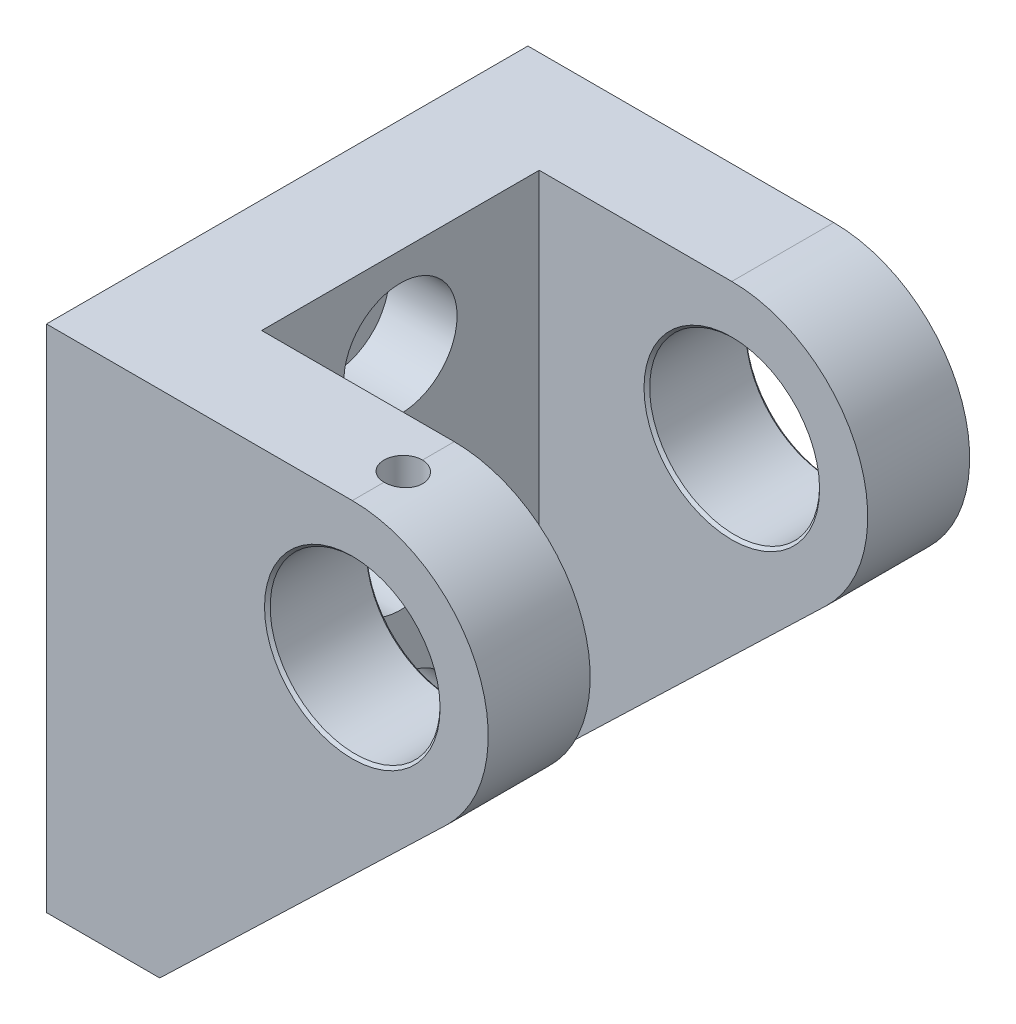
ISO-10303-21;
HEADER;
FILE_DESCRIPTION(('STEP AP214'),'2;1');
FILE_NAME('part.step','',(''),(''),'','','');
FILE_SCHEMA(('AUTOMOTIVE_DESIGN { 1 0 10303 214 1 1 1 1 }'));
ENDSEC;
DATA;
#1=APPLICATION_CONTEXT('core data for automotive mechanical design processes');
#2=APPLICATION_PROTOCOL_DEFINITION('international standard','automotive_design',2000,#1);
#3=PRODUCT_CONTEXT('',#1,'mechanical');
#4=PRODUCT('Part','Part','',(#3));
#5=PRODUCT_RELATED_PRODUCT_CATEGORY('part','',(#4));
#6=PRODUCT_DEFINITION_FORMATION('','',#4);
#7=PRODUCT_DEFINITION_CONTEXT('part definition',#1,'design');
#8=PRODUCT_DEFINITION('design','',#6,#7);
#9=PRODUCT_DEFINITION_SHAPE('','',#8);
#10=(LENGTH_UNIT() NAMED_UNIT(*) SI_UNIT(.MILLI.,.METRE.));
#11=(NAMED_UNIT(*) PLANE_ANGLE_UNIT() SI_UNIT($,.RADIAN.));
#12=(NAMED_UNIT(*) SI_UNIT($,.STERADIAN.) SOLID_ANGLE_UNIT());
#13=UNCERTAINTY_MEASURE_WITH_UNIT(LENGTH_MEASURE(1.E-05),#10,'distance_accuracy_value','');
#14=(GEOMETRIC_REPRESENTATION_CONTEXT(3) GLOBAL_UNCERTAINTY_ASSIGNED_CONTEXT((#13)) GLOBAL_UNIT_ASSIGNED_CONTEXT((#10,
#11,#12)) REPRESENTATION_CONTEXT('',''));
#15=CARTESIAN_POINT('',(0.,0.,0.));
#16=DIRECTION('',(0.,0.,1.));
#17=DIRECTION('',(1.,0.,0.));
#18=AXIS2_PLACEMENT_3D('',#15,#16,#17);
#19=CARTESIAN_POINT('',(0.,0.,42.5));
#20=DIRECTION('',(0.,0.,-1.));
#21=DIRECTION('',(-1.,0.,0.));
#22=AXIS2_PLACEMENT_3D('',#19,#20,#21);
#23=CYLINDRICAL_SURFACE('',#22,24.);
#24=CARTESIAN_POINT('',(0.,0.,-24.5));
#25=DIRECTION('',(0.,0.,1.));
#26=DIRECTION('',(1.,0.,0.));
#27=AXIS2_PLACEMENT_3D('',#24,#25,#26);
#28=CIRCLE('',#27,24.);
#29=CARTESIAN_POINT('',(16.6368956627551,-17.2977947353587,-24.5));
#30=VERTEX_POINT('',#29);
#31=CARTESIAN_POINT('',(0.,24.,-24.5));
#32=VERTEX_POINT('',#31);
#33=EDGE_CURVE('E253',#30,#32,#28,.T.);
#34=ORIENTED_EDGE('',*,*,#33,.F.);
#35=DIRECTION('',(0.,0.,-1.));
#36=VECTOR('',#35,1.);
#37=CARTESIAN_POINT('',(16.6368956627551,-17.2977947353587,42.5));
#38=LINE('',#37,#36);
#39=CARTESIAN_POINT('',(16.6368956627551,-17.2977947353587,-42.5));
#40=VERTEX_POINT('',#39);
#41=EDGE_CURVE('E215',#30,#40,#38,.T.);
#42=ORIENTED_EDGE('',*,*,#41,.T.);
#43=CARTESIAN_POINT('',(0.,0.,-42.5));
#44=DIRECTION('',(0.,0.,1.));
#45=DIRECTION('',(1.,0.,0.));
#46=AXIS2_PLACEMENT_3D('',#43,#44,#45);
#47=CIRCLE('',#46,24.);
#48=CARTESIAN_POINT('',(0.,24.,-42.5));
#49=VERTEX_POINT('',#48);
#50=EDGE_CURVE('E187',#40,#49,#47,.T.);
#51=ORIENTED_EDGE('',*,*,#50,.T.);
#52=DIRECTION('',(0.,0.,-1.));
#53=VECTOR('',#52,1.);
#54=CARTESIAN_POINT('',(0.,24.,42.5));
#55=LINE('',#54,#53);
#56=EDGE_CURVE('E130',#32,#49,#55,.T.);
#57=ORIENTED_EDGE('',*,*,#56,.F.);
#58=EDGE_LOOP('',(#34,#42,#51,#57));
#59=FACE_BOUND('',#58,.T.);
#60=ADVANCED_FACE('F36',(#59),#23,.T.);
#61=CARTESIAN_POINT('',(0.,24.,42.5));
#62=DIRECTION('',(0.,-1.,0.));
#63=DIRECTION('',(1.,0.,0.));
#64=AXIS2_PLACEMENT_3D('',#61,#62,#63);
#65=PLANE('',#64);
#66=CARTESIAN_POINT('',(0.,24.,42.5));
#67=VERTEX_POINT('',#66);
#68=CARTESIAN_POINT('',(0.,24.,36.9));
#69=VERTEX_POINT('',#68);
#70=EDGE_CURVE('E125',#67,#69,#55,.T.);
#71=ORIENTED_EDGE('',*,*,#70,.T.);
#72=CARTESIAN_POINT('',(0.,24.,33.5));
#73=DIRECTION('',(0.,1.,0.));
#74=DIRECTION('',(0.,0.,1.));
#75=AXIS2_PLACEMENT_3D('',#72,#73,#74);
#76=CIRCLE('',#75,3.39999999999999);
#77=CARTESIAN_POINT('',(0.,24.,30.1));
#78=VERTEX_POINT('',#77);
#79=EDGE_CURVE('E50',#78,#69,#76,.T.);
#80=ORIENTED_EDGE('',*,*,#79,.F.);
#81=CARTESIAN_POINT('',(0.,24.,24.5));
#82=VERTEX_POINT('',#81);
#83=EDGE_CURVE('E124',#78,#82,#55,.T.);
#84=ORIENTED_EDGE('',*,*,#83,.T.);
#85=DIRECTION('',(-1.,0.,0.));
#86=VECTOR('',#85,1.);
#87=CARTESIAN_POINT('',(0.,24.,24.5));
#88=LINE('',#87,#86);
#89=CARTESIAN_POINT('',(-34.,24.,24.5));
#90=VERTEX_POINT('',#89);
#91=EDGE_CURVE('E247',#82,#90,#88,.T.);
#92=ORIENTED_EDGE('',*,*,#91,.T.);
#93=DIRECTION('',(0.,0.,1.));
#94=VECTOR('',#93,1.);
#95=CARTESIAN_POINT('',(-34.,24.,-24.5));
#96=LINE('',#95,#94);
#97=CARTESIAN_POINT('',(-34.,24.,-24.5));
#98=VERTEX_POINT('',#97);
#99=EDGE_CURVE('E200',#98,#90,#96,.T.);
#100=ORIENTED_EDGE('',*,*,#99,.F.);
#101=DIRECTION('',(-1.,0.,0.));
#102=VECTOR('',#101,1.);
#103=CARTESIAN_POINT('',(0.,24.,-24.5));
#104=LINE('',#103,#102);
#105=EDGE_CURVE('E242',#32,#98,#104,.T.);
#106=ORIENTED_EDGE('',*,*,#105,.F.);
#107=ORIENTED_EDGE('',*,*,#56,.T.);
#108=DIRECTION('',(-1.,0.,0.));
#109=VECTOR('',#108,1.);
#110=CARTESIAN_POINT('',(0.,24.,-42.5));
#111=LINE('',#110,#109);
#112=CARTESIAN_POINT('',(-54.,24.,-42.5));
#113=VERTEX_POINT('',#112);
#114=EDGE_CURVE('E192',#49,#113,#111,.T.);
#115=ORIENTED_EDGE('',*,*,#114,.T.);
#116=DIRECTION('',(0.,0.,-1.));
#117=VECTOR('',#116,1.);
#118=CARTESIAN_POINT('',(-54.,24.,42.5));
#119=LINE('',#118,#117);
#120=CARTESIAN_POINT('',(-54.,24.,42.5));
#121=VERTEX_POINT('',#120);
#122=EDGE_CURVE('E133',#121,#113,#119,.T.);
#123=ORIENTED_EDGE('',*,*,#122,.F.);
#124=DIRECTION('',(-1.,0.,0.));
#125=VECTOR('',#124,1.);
#126=CARTESIAN_POINT('',(0.,24.,42.5));
#127=LINE('',#126,#125);
#128=EDGE_CURVE('E257',#67,#121,#127,.T.);
#129=ORIENTED_EDGE('',*,*,#128,.F.);
#130=EDGE_LOOP('',(#71,#80,#84,#92,#100,#106,#107,#115,#123,#129));
#131=FACE_BOUND('',#130,.T.);
#132=ADVANCED_FACE('F122',(#131),#65,.F.);
#133=CARTESIAN_POINT('',(-34.,-66.,42.5));
#134=DIRECTION('',(-0.693203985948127,0.720741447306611,0.));
#135=DIRECTION('',(-0.720741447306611,-0.693203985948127,0.));
#136=AXIS2_PLACEMENT_3D('',#133,#134,#135);
#137=PLANE('',#136);
#138=DIRECTION('',(0.720741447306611,0.693203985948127,0.));
#139=VECTOR('',#138,1.);
#140=CARTESIAN_POINT('',(-34.,-66.,-24.5));
#141=LINE('',#140,#139);
#142=CARTESIAN_POINT('',(-34.,-66.,-24.5));
#143=VERTEX_POINT('',#142);
#144=EDGE_CURVE('E236',#143,#30,#141,.T.);
#145=ORIENTED_EDGE('',*,*,#144,.F.);
#146=DIRECTION('',(0.,0.,-1.));
#147=VECTOR('',#146,1.);
#148=CARTESIAN_POINT('',(-34.,-66.,42.5));
#149=LINE('',#148,#147);
#150=CARTESIAN_POINT('',(-34.,-66.,-42.5));
#151=VERTEX_POINT('',#150);
#152=EDGE_CURVE('E214',#143,#151,#149,.T.);
#153=ORIENTED_EDGE('',*,*,#152,.T.);
#154=DIRECTION('',(0.720741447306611,0.693203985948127,0.));
#155=VECTOR('',#154,1.);
#156=CARTESIAN_POINT('',(-34.,-66.,-42.5));
#157=LINE('',#156,#155);
#158=EDGE_CURVE('E190',#151,#40,#157,.T.);
#159=ORIENTED_EDGE('',*,*,#158,.T.);
#160=ORIENTED_EDGE('',*,*,#41,.F.);
#161=EDGE_LOOP('',(#145,#153,#159,#160));
#162=FACE_BOUND('',#161,.T.);
#163=ADVANCED_FACE('F234',(#162),#137,.F.);
#164=ORIENTED_EDGE('',*,*,#83,.F.);
#165=CARTESIAN_POINT('',(0.,24.,30.1));
#166=CARTESIAN_POINT('',(0.0951221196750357,24.0000054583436,30.0999902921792));
#167=CARTESIAN_POINT('',(0.190239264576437,23.9994346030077,30.1039917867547));
#168=CARTESIAN_POINT('',(0.379783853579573,23.9971806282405,30.1199419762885));
#169=CARTESIAN_POINT('',(0.474211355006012,23.9954976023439,30.1318900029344));
#170=CARTESIAN_POINT('',(0.661609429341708,23.9910620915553,30.1636405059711));
#171=CARTESIAN_POINT('',(0.754581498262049,23.9883107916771,30.183434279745));
#172=CARTESIAN_POINT('',(0.938487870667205,23.9818207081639,30.2307084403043));
#173=CARTESIAN_POINT('',(1.02942218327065,23.9780819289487,30.258188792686));
#174=CARTESIAN_POINT('',(1.29826191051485,23.9655285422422,30.3519124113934));
#175=CARTESIAN_POINT('',(1.47231666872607,23.9553740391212,30.4294574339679));
#176=CARTESIAN_POINT('',(1.80483879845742,23.9326229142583,30.6123337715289));
#177=CARTESIAN_POINT('',(1.96330692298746,23.92002641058,30.7176637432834));
#178=CARTESIAN_POINT('',(2.26138306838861,23.8936954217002,30.9539222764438));
#179=CARTESIAN_POINT('',(2.40086901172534,23.8799544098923,31.0850043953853));
#180=CARTESIAN_POINT('',(2.65594936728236,23.8529334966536,31.3687237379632));
#181=CARTESIAN_POINT('',(2.77154006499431,23.8396536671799,31.5213643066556));
#182=CARTESIAN_POINT('',(2.97601422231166,23.8149958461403,31.8446818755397));
#183=CARTESIAN_POINT('',(3.06477931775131,23.803626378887,32.0154344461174));
#184=CARTESIAN_POINT('',(3.21231911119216,23.7841665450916,32.3696018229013));
#185=CARTESIAN_POINT('',(3.27109702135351,23.7760758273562,32.553015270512));
#186=CARTESIAN_POINT('',(3.35662019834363,23.7641530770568,32.9260093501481));
#187=CARTESIAN_POINT('',(3.38357669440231,23.7602929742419,33.1155406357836));
#188=CARTESIAN_POINT('',(3.40534590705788,23.757183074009,33.4964775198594));
#189=CARTESIAN_POINT('',(3.40015949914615,23.7579331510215,33.6878830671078));
#190=CARTESIAN_POINT('',(3.35796191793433,23.7639333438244,34.065639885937));
#191=CARTESIAN_POINT('',(3.32118599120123,23.7691501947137,34.2520180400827));
#192=CARTESIAN_POINT('',(3.21722130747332,23.7834441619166,34.6159300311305));
#193=CARTESIAN_POINT('',(3.15003195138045,23.7925213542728,34.793463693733));
#194=CARTESIAN_POINT('',(2.98689880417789,23.813550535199,35.1353724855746));
#195=CARTESIAN_POINT('',(2.89085392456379,23.8255126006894,35.2996987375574));
#196=CARTESIAN_POINT('',(2.67281194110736,23.8509556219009,35.6099843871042));
#197=CARTESIAN_POINT('',(2.55081436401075,23.8644366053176,35.7559434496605));
#198=CARTESIAN_POINT('',(2.28305344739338,23.8915444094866,36.0267048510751));
#199=CARTESIAN_POINT('',(2.13709078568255,23.9051714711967,36.1513101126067));
#200=CARTESIAN_POINT('',(1.8261656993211,23.9309299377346,36.374320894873));
#201=CARTESIAN_POINT('',(1.66119776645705,23.9430609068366,36.4727187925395));
#202=CARTESIAN_POINT('',(1.31675871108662,23.9644726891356,36.6405270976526));
#203=CARTESIAN_POINT('',(1.13727220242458,23.9737504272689,36.7099062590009));
#204=CARTESIAN_POINT('',(0.769162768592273,23.9883753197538,36.8173830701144));
#205=CARTESIAN_POINT('',(0.580553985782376,23.9937283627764,36.8555275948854));
#206=CARTESIAN_POINT('',(0.325466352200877,23.9978818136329,36.8850193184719));
#207=CARTESIAN_POINT('',(0.260444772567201,23.9986755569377,36.8906396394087));
#208=CARTESIAN_POINT('',(0.130291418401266,23.9997340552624,36.8981249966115));
#209=CARTESIAN_POINT('',(0.0651600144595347,23.9999996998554,36.8999963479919));
#210=CARTESIAN_POINT('',(0.,24.,36.9));
#211=B_SPLINE_CURVE_WITH_KNOTS('',3,(#165,#166,#167,#168,#169,#170,#171,#172,#173,#174,#175,
#176,#177,#178,#179,#180,#181,#182,#183,#184,#185,#186,#187,#188,#189,#190,#191,#192,#193,#194,
#195,#196,#197,#198,#199,#200,#201,#202,#203,#204,#205,#206,#207,#208,#209,#210),.UNSPECIFIED.,
.F.,.F.,(4,2,2,2,2,2,2,2,2,2,2,2,2,2,2,2,2,2,2,2,2,2,4),(0.,0.285271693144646,0.570519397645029,
0.855451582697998,1.14038249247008,1.70990598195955,2.27940194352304,2.85240288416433,
3.42549283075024,4.00107572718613,4.57659695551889,5.14827602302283,5.71993951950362,
6.28738239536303,6.85483644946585,7.4243020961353,7.99377812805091,8.56825582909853,
9.14290044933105,9.71816223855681,10.2925591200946,10.4882845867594,10.6836800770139),.UNSPECIFIED.);
#212=EDGE_CURVE('E112',#78,#69,#211,.T.);
#213=ORIENTED_EDGE('',*,*,#212,.T.);
#214=ORIENTED_EDGE('',*,*,#70,.F.);
#215=CARTESIAN_POINT('',(0.,0.,42.5));
#216=DIRECTION('',(0.,0.,1.));
#217=DIRECTION('',(1.,0.,0.));
#218=AXIS2_PLACEMENT_3D('',#215,#216,#217);
#219=CIRCLE('',#218,24.);
#220=CARTESIAN_POINT('',(16.6368956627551,-17.2977947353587,42.5));
#221=VERTEX_POINT('',#220);
#222=EDGE_CURVE('E211',#221,#67,#219,.T.);
#223=ORIENTED_EDGE('',*,*,#222,.F.);
#224=CARTESIAN_POINT('',(16.6368956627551,-17.2977947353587,24.5));
#225=VERTEX_POINT('',#224);
#226=EDGE_CURVE('E212',#221,#225,#38,.T.);
#227=ORIENTED_EDGE('',*,*,#226,.T.);
#228=CARTESIAN_POINT('',(0.,0.,24.5));
#229=DIRECTION('',(0.,0.,1.));
#230=DIRECTION('',(1.,0.,0.));
#231=AXIS2_PLACEMENT_3D('',#228,#229,#230);
#232=CIRCLE('',#231,24.);
#233=EDGE_CURVE('E58',#225,#82,#232,.T.);
#234=ORIENTED_EDGE('',*,*,#233,.T.);
#235=EDGE_LOOP('',(#164,#213,#214,#223,#227,#234));
#236=FACE_BOUND('',#235,.T.);
#237=ADVANCED_FACE('F128',(#236),#23,.T.);
#238=CARTESIAN_POINT('',(-54.,24.,42.5));
#239=DIRECTION('',(1.,0.,0.));
#240=DIRECTION('',(0.,1.,0.));
#241=AXIS2_PLACEMENT_3D('',#238,#239,#240);
#242=PLANE('',#241);
#243=CARTESIAN_POINT('',(-54.,-58.,15.));
#244=DIRECTION('',(1.,0.,0.));
#245=DIRECTION('',(0.,1.,0.));
#246=AXIS2_PLACEMENT_3D('',#243,#244,#245);
#247=CIRCLE('',#246,3.99999999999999);
#248=CARTESIAN_POINT('',(-54.,-54.,15.));
#249=VERTEX_POINT('',#248);
#250=EDGE_CURVE('E126',#249,#249,#247,.T.);
#251=ORIENTED_EDGE('',*,*,#250,.T.);
#252=EDGE_LOOP('',(#251));
#253=FACE_BOUND('',#252,.T.);
#254=CARTESIAN_POINT('',(-54.,9.,0.));
#255=DIRECTION('',(1.,0.,0.));
#256=DIRECTION('',(0.,0.,-1.));
#257=AXIS2_PLACEMENT_3D('',#254,#255,#256);
#258=CIRCLE('',#257,6.5);
#259=CARTESIAN_POINT('',(-54.,9.,-6.5));
#260=VERTEX_POINT('',#259);
#261=EDGE_CURVE('E118',#260,#260,#258,.T.);
#262=ORIENTED_EDGE('',*,*,#261,.T.);
#263=EDGE_LOOP('',(#262));
#264=FACE_BOUND('',#263,.T.);
#265=CARTESIAN_POINT('',(-54.,-21.,0.));
#266=DIRECTION('',(1.,0.,0.));
#267=DIRECTION('',(0.,0.,-1.));
#268=AXIS2_PLACEMENT_3D('',#265,#266,#267);
#269=CIRCLE('',#268,6.5);
#270=CARTESIAN_POINT('',(-54.,-21.,-6.5));
#271=VERTEX_POINT('',#270);
#272=EDGE_CURVE('E287',#271,#271,#269,.T.);
#273=ORIENTED_EDGE('',*,*,#272,.T.);
#274=EDGE_LOOP('',(#273));
#275=FACE_BOUND('',#274,.T.);
#276=CARTESIAN_POINT('',(-54.,-51.,0.));
#277=DIRECTION('',(1.,0.,0.));
#278=DIRECTION('',(0.,0.,-1.));
#279=AXIS2_PLACEMENT_3D('',#276,#277,#278);
#280=CIRCLE('',#279,6.5);
#281=CARTESIAN_POINT('',(-54.,-51.,-6.5));
#282=VERTEX_POINT('',#281);
#283=EDGE_CURVE('E275',#282,#282,#280,.T.);
#284=ORIENTED_EDGE('',*,*,#283,.T.);
#285=EDGE_LOOP('',(#284));
#286=FACE_BOUND('',#285,.T.);
#287=DIRECTION('',(0.,-1.,0.));
#288=VECTOR('',#287,1.);
#289=CARTESIAN_POINT('',(-54.,24.,-42.5));
#290=LINE('',#289,#288);
#291=CARTESIAN_POINT('',(-54.,-66.,-42.5));
#292=VERTEX_POINT('',#291);
#293=EDGE_CURVE('E197',#113,#292,#290,.T.);
#294=ORIENTED_EDGE('',*,*,#293,.T.);
#295=DIRECTION('',(0.,0.,-1.));
#296=VECTOR('',#295,1.);
#297=CARTESIAN_POINT('',(-54.,-66.,42.5));
#298=LINE('',#297,#296);
#299=CARTESIAN_POINT('',(-54.,-66.,42.5));
#300=VERTEX_POINT('',#299);
#301=EDGE_CURVE('E218',#300,#292,#298,.T.);
#302=ORIENTED_EDGE('',*,*,#301,.F.);
#303=DIRECTION('',(0.,-1.,0.));
#304=VECTOR('',#303,1.);
#305=CARTESIAN_POINT('',(-54.,24.,42.5));
#306=LINE('',#305,#304);
#307=EDGE_CURVE('E228',#121,#300,#306,.T.);
#308=ORIENTED_EDGE('',*,*,#307,.F.);
#309=ORIENTED_EDGE('',*,*,#122,.T.);
#310=EDGE_LOOP('',(#294,#302,#308,#309));
#311=FACE_BOUND('',#310,.T.);
#312=ADVANCED_FACE('F227',(#253,#264,#275,#286,#311),#242,.F.);
#313=CARTESIAN_POINT('',(-54.,-66.,42.5));
#314=DIRECTION('',(0.,1.,0.));
#315=DIRECTION('',(0.,0.,1.));
#316=AXIS2_PLACEMENT_3D('',#313,#314,#315);
#317=PLANE('',#316);
#318=DIRECTION('',(1.,0.,0.));
#319=VECTOR('',#318,1.);
#320=CARTESIAN_POINT('',(-54.,-66.,-42.5));
#321=LINE('',#320,#319);
#322=EDGE_CURVE('E207',#292,#151,#321,.T.);
#323=ORIENTED_EDGE('',*,*,#322,.T.);
#324=ORIENTED_EDGE('',*,*,#152,.F.);
#325=DIRECTION('',(0.,0.,1.));
#326=VECTOR('',#325,1.);
#327=CARTESIAN_POINT('',(-34.,-66.,-24.5));
#328=LINE('',#327,#326);
#329=CARTESIAN_POINT('',(-34.,-66.,24.5));
#330=VERTEX_POINT('',#329);
#331=EDGE_CURVE('E195',#143,#330,#328,.T.);
#332=ORIENTED_EDGE('',*,*,#331,.T.);
#333=CARTESIAN_POINT('',(-34.,-66.,42.5));
#334=VERTEX_POINT('',#333);
#335=EDGE_CURVE('E216',#334,#330,#149,.T.);
#336=ORIENTED_EDGE('',*,*,#335,.F.);
#337=DIRECTION('',(1.,0.,0.));
#338=VECTOR('',#337,1.);
#339=CARTESIAN_POINT('',(-54.,-66.,42.5));
#340=LINE('',#339,#338);
#341=EDGE_CURVE('E259',#300,#334,#340,.T.);
#342=ORIENTED_EDGE('',*,*,#341,.F.);
#343=ORIENTED_EDGE('',*,*,#301,.T.);
#344=EDGE_LOOP('',(#323,#324,#332,#336,#342,#343));
#345=FACE_BOUND('',#344,.T.);
#346=ADVANCED_FACE('F230',(#345),#317,.F.);
#347=ORIENTED_EDGE('',*,*,#335,.T.);
#348=DIRECTION('',(0.720741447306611,0.693203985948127,0.));
#349=VECTOR('',#348,1.);
#350=CARTESIAN_POINT('',(-34.,-66.,24.5));
#351=LINE('',#350,#349);
#352=EDGE_CURVE('E252',#330,#225,#351,.T.);
#353=ORIENTED_EDGE('',*,*,#352,.T.);
#354=ORIENTED_EDGE('',*,*,#226,.F.);
#355=DIRECTION('',(0.720741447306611,0.693203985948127,0.));
#356=VECTOR('',#355,1.);
#357=CARTESIAN_POINT('',(-34.,-66.,42.5));
#358=LINE('',#357,#356);
#359=EDGE_CURVE('E203',#334,#221,#358,.T.);
#360=ORIENTED_EDGE('',*,*,#359,.F.);
#361=EDGE_LOOP('',(#347,#353,#354,#360));
#362=FACE_BOUND('',#361,.T.);
#363=ADVANCED_FACE('F367',(#362),#137,.F.);
#364=CARTESIAN_POINT('',(0.,0.,42.5));
#365=DIRECTION('',(0.,0.,1.));
#366=DIRECTION('',(1.,0.,0.));
#367=AXIS2_PLACEMENT_3D('',#364,#365,#366);
#368=PLANE('',#367);
#369=CARTESIAN_POINT('',(0.,0.,42.5));
#370=DIRECTION('',(0.,0.,1.));
#371=DIRECTION('',(1.,0.,0.));
#372=AXIS2_PLACEMENT_3D('',#369,#370,#371);
#373=CIRCLE('',#372,15.5);
#374=CARTESIAN_POINT('',(15.5,0.,42.5));
#375=VERTEX_POINT('',#374);
#376=EDGE_CURVE('E145',#375,#375,#373,.F.);
#377=ORIENTED_EDGE('',*,*,#376,.T.);
#378=EDGE_LOOP('',(#377));
#379=FACE_BOUND('',#378,.T.);
#380=ORIENTED_EDGE('',*,*,#222,.T.);
#381=ORIENTED_EDGE('',*,*,#128,.T.);
#382=ORIENTED_EDGE('',*,*,#307,.T.);
#383=ORIENTED_EDGE('',*,*,#341,.T.);
#384=ORIENTED_EDGE('',*,*,#359,.T.);
#385=EDGE_LOOP('',(#380,#381,#382,#383,#384));
#386=FACE_BOUND('',#385,.T.);
#387=ADVANCED_FACE('F181',(#379,#386),#368,.T.);
#388=CARTESIAN_POINT('',(0.,0.,-42.5));
#389=DIRECTION('',(0.,0.,1.));
#390=DIRECTION('',(1.,0.,0.));
#391=AXIS2_PLACEMENT_3D('',#388,#389,#390);
#392=PLANE('',#391);
#393=CARTESIAN_POINT('',(0.,0.,-42.5));
#394=DIRECTION('',(0.,0.,1.));
#395=DIRECTION('',(1.,0.,0.));
#396=AXIS2_PLACEMENT_3D('',#393,#394,#395);
#397=CIRCLE('',#396,15.5);
#398=CARTESIAN_POINT('',(15.5,0.,-42.5));
#399=VERTEX_POINT('',#398);
#400=EDGE_CURVE('E11',#399,#399,#397,.T.);
#401=ORIENTED_EDGE('',*,*,#400,.T.);
#402=EDGE_LOOP('',(#401));
#403=FACE_BOUND('',#402,.T.);
#404=ORIENTED_EDGE('',*,*,#50,.F.);
#405=ORIENTED_EDGE('',*,*,#158,.F.);
#406=ORIENTED_EDGE('',*,*,#322,.F.);
#407=ORIENTED_EDGE('',*,*,#293,.F.);
#408=ORIENTED_EDGE('',*,*,#114,.F.);
#409=EDGE_LOOP('',(#404,#405,#406,#407,#408));
#410=FACE_BOUND('',#409,.T.);
#411=ADVANCED_FACE('F177',(#403,#410),#392,.F.);
#412=CARTESIAN_POINT('',(-34.,24.,-24.5));
#413=DIRECTION('',(-1.,0.,0.));
#414=DIRECTION('',(0.,-1.,0.));
#415=AXIS2_PLACEMENT_3D('',#412,#413,#414);
#416=PLANE('',#415);
#417=CARTESIAN_POINT('',(-34.,-58.,15.));
#418=DIRECTION('',(1.,0.,0.));
#419=DIRECTION('',(0.,0.,-1.));
#420=AXIS2_PLACEMENT_3D('',#417,#418,#419);
#421=CIRCLE('',#420,3.99999999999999);
#422=CARTESIAN_POINT('',(-34.,-58.,11.));
#423=VERTEX_POINT('',#422);
#424=EDGE_CURVE('E587',#423,#423,#421,.T.);
#425=ORIENTED_EDGE('',*,*,#424,.F.);
#426=EDGE_LOOP('',(#425));
#427=FACE_BOUND('',#426,.T.);
#428=CARTESIAN_POINT('',(-34.,9.,0.));
#429=DIRECTION('',(1.,0.,0.));
#430=DIRECTION('',(0.,0.,-1.));
#431=AXIS2_PLACEMENT_3D('',#428,#429,#430);
#432=CIRCLE('',#431,10.);
#433=CARTESIAN_POINT('',(-34.,9.,-10.));
#434=VERTEX_POINT('',#433);
#435=EDGE_CURVE('E290',#434,#434,#432,.T.);
#436=ORIENTED_EDGE('',*,*,#435,.F.);
#437=EDGE_LOOP('',(#436));
#438=FACE_BOUND('',#437,.T.);
#439=CARTESIAN_POINT('',(-34.,-21.,0.));
#440=DIRECTION('',(1.,0.,0.));
#441=DIRECTION('',(0.,0.,-1.));
#442=AXIS2_PLACEMENT_3D('',#439,#440,#441);
#443=CIRCLE('',#442,10.);
#444=CARTESIAN_POINT('',(-34.,-21.,-10.));
#445=VERTEX_POINT('',#444);
#446=EDGE_CURVE('E278',#445,#445,#443,.T.);
#447=ORIENTED_EDGE('',*,*,#446,.F.);
#448=EDGE_LOOP('',(#447));
#449=FACE_BOUND('',#448,.T.);
#450=CARTESIAN_POINT('',(-34.,-51.,0.));
#451=DIRECTION('',(1.,0.,0.));
#452=DIRECTION('',(0.,0.,-1.));
#453=AXIS2_PLACEMENT_3D('',#450,#451,#452);
#454=CIRCLE('',#453,10.);
#455=CARTESIAN_POINT('',(-34.,-51.,-10.));
#456=VERTEX_POINT('',#455);
#457=EDGE_CURVE('E248',#456,#456,#454,.T.);
#458=ORIENTED_EDGE('',*,*,#457,.F.);
#459=EDGE_LOOP('',(#458));
#460=FACE_BOUND('',#459,.T.);
#461=DIRECTION('',(0.,-1.,0.));
#462=VECTOR('',#461,1.);
#463=CARTESIAN_POINT('',(-34.,24.,24.5));
#464=LINE('',#463,#462);
#465=EDGE_CURVE('E250',#90,#330,#464,.T.);
#466=ORIENTED_EDGE('',*,*,#465,.T.);
#467=ORIENTED_EDGE('',*,*,#331,.F.);
#468=DIRECTION('',(0.,-1.,0.));
#469=VECTOR('',#468,1.);
#470=CARTESIAN_POINT('',(-34.,24.,-24.5));
#471=LINE('',#470,#469);
#472=EDGE_CURVE('E239',#98,#143,#471,.T.);
#473=ORIENTED_EDGE('',*,*,#472,.F.);
#474=ORIENTED_EDGE('',*,*,#99,.T.);
#475=EDGE_LOOP('',(#466,#467,#473,#474));
#476=FACE_BOUND('',#475,.T.);
#477=ADVANCED_FACE('F180',(#427,#438,#449,#460,#476),#416,.F.);
#478=CARTESIAN_POINT('',(0.,0.,-24.5));
#479=DIRECTION('',(0.,0.,1.));
#480=DIRECTION('',(1.,0.,0.));
#481=AXIS2_PLACEMENT_3D('',#478,#479,#480);
#482=PLANE('',#481);
#483=CARTESIAN_POINT('',(0.,0.,-24.5));
#484=DIRECTION('',(0.,0.,1.));
#485=DIRECTION('',(1.,0.,0.));
#486=AXIS2_PLACEMENT_3D('',#483,#484,#485);
#487=CIRCLE('',#486,15.5);
#488=CARTESIAN_POINT('',(15.5,0.,-24.5));
#489=VERTEX_POINT('',#488);
#490=EDGE_CURVE('E44',#489,#489,#487,.F.);
#491=ORIENTED_EDGE('',*,*,#490,.T.);
#492=EDGE_LOOP('',(#491));
#493=FACE_BOUND('',#492,.T.);
#494=ORIENTED_EDGE('',*,*,#33,.T.);
#495=ORIENTED_EDGE('',*,*,#105,.T.);
#496=ORIENTED_EDGE('',*,*,#472,.T.);
#497=ORIENTED_EDGE('',*,*,#144,.T.);
#498=EDGE_LOOP('',(#494,#495,#496,#497));
#499=FACE_BOUND('',#498,.T.);
#500=ADVANCED_FACE('F156',(#493,#499),#482,.T.);
#501=CARTESIAN_POINT('',(0.,0.,24.5));
#502=DIRECTION('',(0.,0.,1.));
#503=DIRECTION('',(1.,0.,0.));
#504=AXIS2_PLACEMENT_3D('',#501,#502,#503);
#505=PLANE('',#504);
#506=CARTESIAN_POINT('',(0.,0.,24.5));
#507=DIRECTION('',(0.,0.,1.));
#508=DIRECTION('',(1.,0.,0.));
#509=AXIS2_PLACEMENT_3D('',#506,#507,#508);
#510=CIRCLE('',#509,15.5);
#511=CARTESIAN_POINT('',(15.5,0.,24.5));
#512=VERTEX_POINT('',#511);
#513=EDGE_CURVE('E132',#512,#512,#510,.T.);
#514=ORIENTED_EDGE('',*,*,#513,.T.);
#515=EDGE_LOOP('',(#514));
#516=FACE_BOUND('',#515,.T.);
#517=ORIENTED_EDGE('',*,*,#233,.F.);
#518=ORIENTED_EDGE('',*,*,#352,.F.);
#519=ORIENTED_EDGE('',*,*,#465,.F.);
#520=ORIENTED_EDGE('',*,*,#91,.F.);
#521=EDGE_LOOP('',(#517,#518,#519,#520));
#522=FACE_BOUND('',#521,.T.);
#523=ADVANCED_FACE('F359',(#516,#522),#505,.F.);
#524=CARTESIAN_POINT('',(0.,0.,-42.5));
#525=DIRECTION('',(0.,0.,1.));
#526=DIRECTION('',(1.,0.,0.));
#527=AXIS2_PLACEMENT_3D('',#524,#525,#526);
#528=CYLINDRICAL_SURFACE('',#527,15.);
#529=CARTESIAN_POINT('',(0.,0.,25.));
#530=DIRECTION('',(0.,0.,1.));
#531=DIRECTION('',(1.,0.,0.));
#532=AXIS2_PLACEMENT_3D('',#529,#530,#531);
#533=CIRCLE('',#532,15.);
#534=CARTESIAN_POINT('',(15.,0.,25.));
#535=VERTEX_POINT('',#534);
#536=EDGE_CURVE('E142',#535,#535,#533,.F.);
#537=ORIENTED_EDGE('',*,*,#536,.T.);
#538=EDGE_LOOP('',(#537));
#539=FACE_BOUND('',#538,.T.);
#540=CARTESIAN_POINT('',(0.,0.,42.));
#541=DIRECTION('',(0.,0.,1.));
#542=DIRECTION('',(1.,0.,0.));
#543=AXIS2_PLACEMENT_3D('',#540,#541,#542);
#544=CIRCLE('',#543,15.);
#545=CARTESIAN_POINT('',(15.,0.,42.));
#546=VERTEX_POINT('',#545);
#547=EDGE_CURVE('E139',#546,#546,#544,.T.);
#548=ORIENTED_EDGE('',*,*,#547,.T.);
#549=EDGE_LOOP('',(#548));
#550=FACE_BOUND('',#549,.T.);
#551=CARTESIAN_POINT('',(0.,15.,36.9));
#552=CARTESIAN_POINT('',(0.188398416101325,14.9999965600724,36.8999938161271));
#553=CARTESIAN_POINT('',(0.376870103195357,14.9964147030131,36.8842880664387));
#554=CARTESIAN_POINT('',(0.748448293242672,14.9824721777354,36.8219522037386));
#555=CARTESIAN_POINT('',(0.931551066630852,14.9721069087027,36.7753011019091));
#556=CARTESIAN_POINT('',(1.28696868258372,14.9457501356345,36.6526200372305));
#557=CARTESIAN_POINT('',(1.4592949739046,14.9297647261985,36.5766218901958));
#558=CARTESIAN_POINT('',(1.78874674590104,14.8938873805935,36.3975077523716));
#559=CARTESIAN_POINT('',(1.94587239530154,14.8739954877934,36.2943920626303));
#560=CARTESIAN_POINT('',(2.24316295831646,14.8320979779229,36.0620984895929));
#561=CARTESIAN_POINT('',(2.38302976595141,14.8100645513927,35.9325440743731));
#562=CARTESIAN_POINT('',(2.63924596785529,14.7665604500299,35.6518584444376));
#563=CARTESIAN_POINT('',(2.75559313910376,14.745089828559,35.5007251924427));
#564=CARTESIAN_POINT('',(2.96280355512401,14.7048667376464,35.1789411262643));
#565=CARTESIAN_POINT('',(3.05334554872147,14.6861498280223,35.0080786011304));
#566=CARTESIAN_POINT('',(3.20431355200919,14.6539541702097,34.6530682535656));
#567=CARTESIAN_POINT('',(3.26474345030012,14.6404747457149,34.4689221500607));
#568=CARTESIAN_POINT('',(3.35277893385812,14.62056415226,34.0958167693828));
#569=CARTESIAN_POINT('',(3.38091436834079,14.6140193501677,33.9069887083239));
#570=CARTESIAN_POINT('',(3.40521049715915,14.6083780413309,33.5271878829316));
#571=CARTESIAN_POINT('',(3.40137542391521,14.6092805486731,33.3362154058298));
#572=CARTESIAN_POINT('',(3.36226490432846,14.6183291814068,32.9615146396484));
#573=CARTESIAN_POINT('',(3.32760872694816,14.6263326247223,32.7777177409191));
#574=CARTESIAN_POINT('',(3.2288225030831,14.6484553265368,32.418616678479));
#575=CARTESIAN_POINT('',(3.16469069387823,14.6625749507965,32.2433130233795));
#576=CARTESIAN_POINT('',(3.00821508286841,14.6954773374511,31.9044533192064));
#577=CARTESIAN_POINT('',(2.9156364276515,14.7142986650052,31.7410096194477));
#578=CARTESIAN_POINT('',(2.70505999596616,14.7544605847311,31.4317496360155));
#579=CARTESIAN_POINT('',(2.58705851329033,14.7758015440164,31.2859359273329));
#580=CARTESIAN_POINT('',(2.32572493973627,14.819207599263,31.0125135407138));
#581=CARTESIAN_POINT('',(2.1818671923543,14.8412779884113,30.8854075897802));
#582=CARTESIAN_POINT('',(1.87462374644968,14.883204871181,30.6570397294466));
#583=CARTESIAN_POINT('',(1.71123764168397,14.9030613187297,30.5557783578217));
#584=CARTESIAN_POINT('',(1.36893681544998,14.938395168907,30.3818355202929));
#585=CARTESIAN_POINT('',(1.18998551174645,14.9538618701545,30.309223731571));
#586=CARTESIAN_POINT('',(0.821991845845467,14.9785945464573,30.1952434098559));
#587=CARTESIAN_POINT('',(0.632951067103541,14.9878614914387,30.1538699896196));
#588=CARTESIAN_POINT('',(0.254453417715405,14.9990111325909,30.1042808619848));
#589=CARTESIAN_POINT('',(0.065090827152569,15.0010466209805,30.0953789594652));
#590=CARTESIAN_POINT('',(-0.312416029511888,14.9979338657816,30.1091203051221));
#591=CARTESIAN_POINT('',(-0.500560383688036,14.9927861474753,30.1317612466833));
#592=CARTESIAN_POINT('',(-0.867989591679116,14.9759821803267,30.2073772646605));
#593=CARTESIAN_POINT('',(-1.04735312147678,14.9644039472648,30.2599889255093));
#594=CARTESIAN_POINT('',(-1.39470739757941,14.9360365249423,30.3936467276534));
#595=CARTESIAN_POINT('',(-1.56269712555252,14.9192468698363,30.474695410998));
#596=CARTESIAN_POINT('',(-1.88534686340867,14.8819443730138,30.6643319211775));
#597=CARTESIAN_POINT('',(-2.03976639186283,14.8613789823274,30.7733183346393));
#598=CARTESIAN_POINT('',(-2.32837060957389,14.818907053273,31.0152155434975));
#599=CARTESIAN_POINT('',(-2.46255245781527,14.7970003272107,31.1481296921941));
#600=CARTESIAN_POINT('',(-2.70961367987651,14.753781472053,31.4372682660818));
#601=CARTESIAN_POINT('',(-2.82201624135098,14.7324898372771,31.593903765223));
#602=CARTESIAN_POINT('',(-3.0189258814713,14.6934068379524,31.9242296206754));
#603=CARTESIAN_POINT('',(-3.10343419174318,14.6756153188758,32.0979192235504));
#604=CARTESIAN_POINT('',(-3.24156644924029,14.645724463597,32.4564789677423));
#605=CARTESIAN_POINT('',(-3.29536818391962,14.6335924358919,32.6412777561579));
#606=CARTESIAN_POINT('',(-3.37107068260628,14.6163407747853,33.0176059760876));
#607=CARTESIAN_POINT('',(-3.39297698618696,14.6112199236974,33.2091342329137));
#608=CARTESIAN_POINT('',(-3.40401761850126,14.6086511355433,33.5886670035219));
#609=CARTESIAN_POINT('',(-3.39390928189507,14.6110258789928,33.776648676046));
#610=CARTESIAN_POINT('',(-3.34291038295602,14.6227775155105,34.1481544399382));
#611=CARTESIAN_POINT('',(-3.30202024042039,14.6321543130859,34.331678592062));
#612=CARTESIAN_POINT('',(-3.19099639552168,14.656763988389,34.688404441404));
#613=CARTESIAN_POINT('',(-3.12098065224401,14.6719732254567,34.8616445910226));
#614=CARTESIAN_POINT('',(-2.95379168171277,14.706541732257,35.1940289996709));
#615=CARTESIAN_POINT('',(-2.85661538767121,14.7259014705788,35.3531716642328));
#616=CARTESIAN_POINT('',(-2.63538535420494,14.7671135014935,35.6565594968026));
#617=CARTESIAN_POINT('',(-2.51079524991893,14.7890106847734,35.8004075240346));
#618=CARTESIAN_POINT('',(-2.23935138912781,14.8325373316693,36.0654024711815));
#619=CARTESIAN_POINT('',(-2.09249246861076,14.8541667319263,36.186544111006));
#620=CARTESIAN_POINT('',(-1.77817220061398,14.895084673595,36.404337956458));
#621=CARTESIAN_POINT('',(-1.61044858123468,14.9143357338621,36.5006191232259));
#622=CARTESIAN_POINT('',(-1.26079154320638,14.947947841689,36.6634688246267));
#623=CARTESIAN_POINT('',(-1.07886977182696,14.9623128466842,36.730061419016));
#624=CARTESIAN_POINT('',(-0.747399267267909,14.9820757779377,36.8202476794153));
#625=CARTESIAN_POINT('',(-0.599596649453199,14.988754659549,36.8500959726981));
#626=CARTESIAN_POINT('',(-0.301211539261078,14.9977180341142,36.8899741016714));
#627=CARTESIAN_POINT('',(-0.150629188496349,15.0000027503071,36.9000049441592));
#628=CARTESIAN_POINT('',(0.,15.,36.9));
#629=B_SPLINE_CURVE_WITH_KNOTS('',3,(#551,#552,#553,#554,#555,#556,#557,#558,#559,#560,#561,
#562,#563,#564,#565,#566,#567,#568,#569,#570,#571,#572,#573,#574,#575,#576,#577,#578,#579,#580,
#581,#582,#583,#584,#585,#586,#587,#588,#589,#590,#591,#592,#593,#594,#595,#596,#597,#598,#599,
#600,#601,#602,#603,#604,#605,#606,#607,#608,#609,#610,#611,#612,#613,#614,#615,#616,#617,#618,
#619,#620,#621,#622,#623,#624,#625,#626,#627,#628),.UNSPECIFIED.,.T.,.F.,(4,2,2,2,2,2,2,2,2,2,2,
2,2,2,2,2,2,2,2,2,2,2,2,2,2,2,2,2,2,2,2,2,2,2,2,2,2,2,4),(0.,0.564643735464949,1.12967083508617,
1.69408708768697,2.25849707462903,2.83158982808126,3.40473672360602,3.98473482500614,
4.56465800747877,5.13492402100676,5.70511454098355,6.26410109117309,6.82312107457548,
7.38688623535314,7.95073363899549,8.52770490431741,9.10468817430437,9.68306617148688,
10.2613536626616,10.8273474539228,11.3932998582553,11.952531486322,12.5118131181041,
13.0795672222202,13.6474009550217,14.2265293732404,14.8056322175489,15.3813471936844,
15.9569621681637,16.5190630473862,17.0811562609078,17.640994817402,18.2008966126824,
18.7729206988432,19.3450776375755,19.9253358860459,20.5051230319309,20.9565925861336,
21.4080392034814),.UNSPECIFIED.);
#630=CARTESIAN_POINT('',(0.,15.,36.9));
#631=VERTEX_POINT('',#630);
#632=EDGE_CURVE('E119',#631,#631,#629,.T.);
#633=ORIENTED_EDGE('',*,*,#632,.T.);
#634=EDGE_LOOP('',(#633));
#635=FACE_BOUND('',#634,.T.);
#636=ADVANCED_FACE('F169',(#539,#550,#635),#528,.F.);
#637=CARTESIAN_POINT('',(0.,0.,-25.));
#638=DIRECTION('',(0.,0.,1.));
#639=DIRECTION('',(1.,0.,0.));
#640=AXIS2_PLACEMENT_3D('',#637,#638,#639);
#641=CIRCLE('',#640,15.);
#642=CARTESIAN_POINT('',(15.,0.,-25.));
#643=VERTEX_POINT('',#642);
#644=EDGE_CURVE('E151',#643,#643,#641,.T.);
#645=ORIENTED_EDGE('',*,*,#644,.T.);
#646=EDGE_LOOP('',(#645));
#647=FACE_BOUND('',#646,.T.);
#648=CARTESIAN_POINT('',(0.,0.,-42.));
#649=DIRECTION('',(0.,0.,1.));
#650=DIRECTION('',(1.,0.,0.));
#651=AXIS2_PLACEMENT_3D('',#648,#649,#650);
#652=CIRCLE('',#651,15.);
#653=CARTESIAN_POINT('',(15.,0.,-42.));
#654=VERTEX_POINT('',#653);
#655=EDGE_CURVE('E148',#654,#654,#652,.F.);
#656=ORIENTED_EDGE('',*,*,#655,.T.);
#657=EDGE_LOOP('',(#656));
#658=FACE_BOUND('',#657,.T.);
#659=ADVANCED_FACE('F165',(#647,#658),#528,.F.);
#660=CARTESIAN_POINT('',(-34.,-51.,0.));
#661=DIRECTION('',(1.,0.,0.));
#662=DIRECTION('',(0.,0.,-1.));
#663=AXIS2_PLACEMENT_3D('',#660,#661,#662);
#664=CYLINDRICAL_SURFACE('',#663,10.);
#665=CARTESIAN_POINT('',(-46.,-51.,0.));
#666=DIRECTION('',(1.,0.,0.));
#667=DIRECTION('',(0.,0.,-1.));
#668=AXIS2_PLACEMENT_3D('',#665,#666,#667);
#669=CIRCLE('',#668,9.99999999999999);
#670=CARTESIAN_POINT('',(-46.,-51.,-9.99999999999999));
#671=VERTEX_POINT('',#670);
#672=EDGE_CURVE('E269',#671,#671,#669,.T.);
#673=ORIENTED_EDGE('',*,*,#672,.F.);
#674=EDGE_LOOP('',(#673));
#675=FACE_BOUND('',#674,.T.);
#676=ORIENTED_EDGE('',*,*,#457,.T.);
#677=EDGE_LOOP('',(#676));
#678=FACE_BOUND('',#677,.T.);
#679=ADVANCED_FACE('F168',(#675,#678),#664,.F.);
#680=CARTESIAN_POINT('',(-46.,-44.5,0.));
#681=DIRECTION('',(-1.,0.,0.));
#682=DIRECTION('',(0.,0.,1.));
#683=AXIS2_PLACEMENT_3D('',#680,#681,#682);
#684=PLANE('',#683);
#685=CARTESIAN_POINT('',(-46.,-51.,0.));
#686=DIRECTION('',(1.,0.,0.));
#687=DIRECTION('',(0.,0.,-1.));
#688=AXIS2_PLACEMENT_3D('',#685,#686,#687);
#689=CIRCLE('',#688,6.5);
#690=CARTESIAN_POINT('',(-46.,-51.,-6.5));
#691=VERTEX_POINT('',#690);
#692=EDGE_CURVE('E272',#691,#691,#689,.T.);
#693=ORIENTED_EDGE('',*,*,#692,.F.);
#694=EDGE_LOOP('',(#693));
#695=FACE_BOUND('',#694,.T.);
#696=ORIENTED_EDGE('',*,*,#672,.T.);
#697=EDGE_LOOP('',(#696));
#698=FACE_BOUND('',#697,.T.);
#699=ADVANCED_FACE('F349',(#695,#698),#684,.F.);
#700=CARTESIAN_POINT('',(-34.,-51.,0.));
#701=DIRECTION('',(1.,0.,0.));
#702=DIRECTION('',(0.,0.,-1.));
#703=AXIS2_PLACEMENT_3D('',#700,#701,#702);
#704=CYLINDRICAL_SURFACE('',#703,6.5);
#705=ORIENTED_EDGE('',*,*,#283,.F.);
#706=EDGE_LOOP('',(#705));
#707=FACE_BOUND('',#706,.T.);
#708=ORIENTED_EDGE('',*,*,#692,.T.);
#709=EDGE_LOOP('',(#708));
#710=FACE_BOUND('',#709,.T.);
#711=ADVANCED_FACE('F345',(#707,#710),#704,.F.);
#712=CARTESIAN_POINT('',(-34.,-21.,0.));
#713=DIRECTION('',(1.,0.,0.));
#714=DIRECTION('',(0.,0.,-1.));
#715=AXIS2_PLACEMENT_3D('',#712,#713,#714);
#716=CYLINDRICAL_SURFACE('',#715,10.);
#717=CARTESIAN_POINT('',(-46.,-21.,0.));
#718=DIRECTION('',(1.,0.,0.));
#719=DIRECTION('',(0.,0.,-1.));
#720=AXIS2_PLACEMENT_3D('',#717,#718,#719);
#721=CIRCLE('',#720,10.);
#722=CARTESIAN_POINT('',(-46.,-21.,-10.));
#723=VERTEX_POINT('',#722);
#724=EDGE_CURVE('E281',#723,#723,#721,.T.);
#725=ORIENTED_EDGE('',*,*,#724,.F.);
#726=EDGE_LOOP('',(#725));
#727=FACE_BOUND('',#726,.T.);
#728=ORIENTED_EDGE('',*,*,#446,.T.);
#729=EDGE_LOOP('',(#728));
#730=FACE_BOUND('',#729,.T.);
#731=ADVANCED_FACE('F341',(#727,#730),#716,.F.);
#732=CARTESIAN_POINT('',(-46.,-14.5,0.));
#733=DIRECTION('',(-1.,0.,0.));
#734=DIRECTION('',(0.,0.,1.));
#735=AXIS2_PLACEMENT_3D('',#732,#733,#734);
#736=PLANE('',#735);
#737=CARTESIAN_POINT('',(-46.,-21.,0.));
#738=DIRECTION('',(1.,0.,0.));
#739=DIRECTION('',(0.,0.,-1.));
#740=AXIS2_PLACEMENT_3D('',#737,#738,#739);
#741=CIRCLE('',#740,6.5);
#742=CARTESIAN_POINT('',(-46.,-21.,-6.5));
#743=VERTEX_POINT('',#742);
#744=EDGE_CURVE('E284',#743,#743,#741,.T.);
#745=ORIENTED_EDGE('',*,*,#744,.F.);
#746=EDGE_LOOP('',(#745));
#747=FACE_BOUND('',#746,.T.);
#748=ORIENTED_EDGE('',*,*,#724,.T.);
#749=EDGE_LOOP('',(#748));
#750=FACE_BOUND('',#749,.T.);
#751=ADVANCED_FACE('F337',(#747,#750),#736,.F.);
#752=CARTESIAN_POINT('',(-34.,-21.,0.));
#753=DIRECTION('',(1.,0.,0.));
#754=DIRECTION('',(0.,0.,-1.));
#755=AXIS2_PLACEMENT_3D('',#752,#753,#754);
#756=CYLINDRICAL_SURFACE('',#755,6.5);
#757=ORIENTED_EDGE('',*,*,#272,.F.);
#758=EDGE_LOOP('',(#757));
#759=FACE_BOUND('',#758,.T.);
#760=ORIENTED_EDGE('',*,*,#744,.T.);
#761=EDGE_LOOP('',(#760));
#762=FACE_BOUND('',#761,.T.);
#763=ADVANCED_FACE('F333',(#759,#762),#756,.F.);
#764=CARTESIAN_POINT('',(-34.,9.,0.));
#765=DIRECTION('',(1.,0.,0.));
#766=DIRECTION('',(0.,0.,-1.));
#767=AXIS2_PLACEMENT_3D('',#764,#765,#766);
#768=CYLINDRICAL_SURFACE('',#767,10.);
#769=CARTESIAN_POINT('',(-46.,9.,0.));
#770=DIRECTION('',(1.,0.,0.));
#771=DIRECTION('',(0.,0.,-1.));
#772=AXIS2_PLACEMENT_3D('',#769,#770,#771);
#773=CIRCLE('',#772,10.);
#774=CARTESIAN_POINT('',(-46.,9.,-10.));
#775=VERTEX_POINT('',#774);
#776=EDGE_CURVE('E293',#775,#775,#773,.T.);
#777=ORIENTED_EDGE('',*,*,#776,.F.);
#778=EDGE_LOOP('',(#777));
#779=FACE_BOUND('',#778,.T.);
#780=ORIENTED_EDGE('',*,*,#435,.T.);
#781=EDGE_LOOP('',(#780));
#782=FACE_BOUND('',#781,.T.);
#783=ADVANCED_FACE('F329',(#779,#782),#768,.F.);
#784=CARTESIAN_POINT('',(-46.,15.5,0.));
#785=DIRECTION('',(-1.,0.,0.));
#786=DIRECTION('',(0.,0.,1.));
#787=AXIS2_PLACEMENT_3D('',#784,#785,#786);
#788=PLANE('',#787);
#789=CARTESIAN_POINT('',(-46.,9.,0.));
#790=DIRECTION('',(1.,0.,0.));
#791=DIRECTION('',(0.,0.,-1.));
#792=AXIS2_PLACEMENT_3D('',#789,#790,#791);
#793=CIRCLE('',#792,6.5);
#794=CARTESIAN_POINT('',(-46.,9.,-6.5));
#795=VERTEX_POINT('',#794);
#796=EDGE_CURVE('E296',#795,#795,#793,.T.);
#797=ORIENTED_EDGE('',*,*,#796,.F.);
#798=EDGE_LOOP('',(#797));
#799=FACE_BOUND('',#798,.T.);
#800=ORIENTED_EDGE('',*,*,#776,.T.);
#801=EDGE_LOOP('',(#800));
#802=FACE_BOUND('',#801,.T.);
#803=ADVANCED_FACE('F325',(#799,#802),#788,.F.);
#804=CARTESIAN_POINT('',(-34.,9.,0.));
#805=DIRECTION('',(1.,0.,0.));
#806=DIRECTION('',(0.,0.,-1.));
#807=AXIS2_PLACEMENT_3D('',#804,#805,#806);
#808=CYLINDRICAL_SURFACE('',#807,6.5);
#809=ORIENTED_EDGE('',*,*,#261,.F.);
#810=EDGE_LOOP('',(#809));
#811=FACE_BOUND('',#810,.T.);
#812=ORIENTED_EDGE('',*,*,#796,.T.);
#813=EDGE_LOOP('',(#812));
#814=FACE_BOUND('',#813,.T.);
#815=ADVANCED_FACE('F318',(#811,#814),#808,.F.);
#816=CARTESIAN_POINT('',(0.,24.,33.5));
#817=DIRECTION('',(0.,1.,0.));
#818=DIRECTION('',(0.,0.,1.));
#819=AXIS2_PLACEMENT_3D('',#816,#817,#818);
#820=CYLINDRICAL_SURFACE('',#819,3.39999999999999);
#821=ORIENTED_EDGE('',*,*,#632,.F.);
#822=EDGE_LOOP('',(#821));
#823=FACE_BOUND('',#822,.T.);
#824=ORIENTED_EDGE('',*,*,#79,.T.);
#825=ORIENTED_EDGE('',*,*,#212,.F.);
#826=EDGE_LOOP('',(#824,#825));
#827=FACE_BOUND('',#826,.T.);
#828=ADVANCED_FACE('F113',(#823,#827),#820,.F.);
#829=CARTESIAN_POINT('',(-34.,-58.,15.));
#830=DIRECTION('',(1.,0.,0.));
#831=DIRECTION('',(0.,0.,-1.));
#832=AXIS2_PLACEMENT_3D('',#829,#830,#831);
#833=CYLINDRICAL_SURFACE('',#832,3.99999999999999);
#834=ORIENTED_EDGE('',*,*,#250,.F.);
#835=EDGE_LOOP('',(#834));
#836=FACE_BOUND('',#835,.T.);
#837=ORIENTED_EDGE('',*,*,#424,.T.);
#838=EDGE_LOOP('',(#837));
#839=FACE_BOUND('',#838,.T.);
#840=ADVANCED_FACE('F317',(#836,#839),#833,.F.);
#841=CARTESIAN_POINT('',(0.,0.,24.5));
#842=DIRECTION('',(0.,0.,-1.));
#843=DIRECTION('',(-1.,0.,0.));
#844=AXIS2_PLACEMENT_3D('',#841,#842,#843);
#845=CONICAL_SURFACE('',#844,15.5,0.785398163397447);
#846=ORIENTED_EDGE('',*,*,#536,.F.);
#847=EDGE_LOOP('',(#846));
#848=FACE_BOUND('',#847,.T.);
#849=ORIENTED_EDGE('',*,*,#513,.F.);
#850=EDGE_LOOP('',(#849));
#851=FACE_BOUND('',#850,.T.);
#852=ADVANCED_FACE('F479',(#848,#851),#845,.F.);
#853=CARTESIAN_POINT('',(0.,0.,42.));
#854=DIRECTION('',(0.,0.,1.));
#855=DIRECTION('',(1.,0.,0.));
#856=AXIS2_PLACEMENT_3D('',#853,#854,#855);
#857=CONICAL_SURFACE('',#856,15.,0.785398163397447);
#858=ORIENTED_EDGE('',*,*,#376,.F.);
#859=EDGE_LOOP('',(#858));
#860=FACE_BOUND('',#859,.T.);
#861=ORIENTED_EDGE('',*,*,#547,.F.);
#862=EDGE_LOOP('',(#861));
#863=FACE_BOUND('',#862,.T.);
#864=ADVANCED_FACE('F162',(#860,#863),#857,.F.);
#865=CARTESIAN_POINT('',(0.,0.,-25.));
#866=DIRECTION('',(0.,0.,1.));
#867=DIRECTION('',(1.,0.,0.));
#868=AXIS2_PLACEMENT_3D('',#865,#866,#867);
#869=CONICAL_SURFACE('',#868,15.,0.785398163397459);
#870=ORIENTED_EDGE('',*,*,#490,.F.);
#871=EDGE_LOOP('',(#870));
#872=FACE_BOUND('',#871,.T.);
#873=ORIENTED_EDGE('',*,*,#644,.F.);
#874=EDGE_LOOP('',(#873));
#875=FACE_BOUND('',#874,.T.);
#876=ADVANCED_FACE('F159',(#872,#875),#869,.F.);
#877=CARTESIAN_POINT('',(0.,0.,-42.5));
#878=DIRECTION('',(0.,0.,-1.));
#879=DIRECTION('',(-1.,0.,0.));
#880=AXIS2_PLACEMENT_3D('',#877,#878,#879);
#881=CONICAL_SURFACE('',#880,15.5,0.78539816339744);
#882=ORIENTED_EDGE('',*,*,#655,.F.);
#883=EDGE_LOOP('',(#882));
#884=FACE_BOUND('',#883,.T.);
#885=ORIENTED_EDGE('',*,*,#400,.F.);
#886=EDGE_LOOP('',(#885));
#887=FACE_BOUND('',#886,.T.);
#888=ADVANCED_FACE('F38',(#884,#887),#881,.F.);
#889=CLOSED_SHELL('',(#60,#132,#163,#237,#312,#346,#363,#387,#411,#477,#500,#523,#636,#659,#679,
#699,#711,#731,#751,#763,#783,#803,#815,#828,#840,#852,#864,#876,#888));
#890=MANIFOLD_SOLID_BREP('B2',#889);
#891=ADVANCED_BREP_SHAPE_REPRESENTATION('',(#18,#890),#14);
#892=SHAPE_DEFINITION_REPRESENTATION(#9,#891);
ENDSEC;
END-ISO-10303-21;
